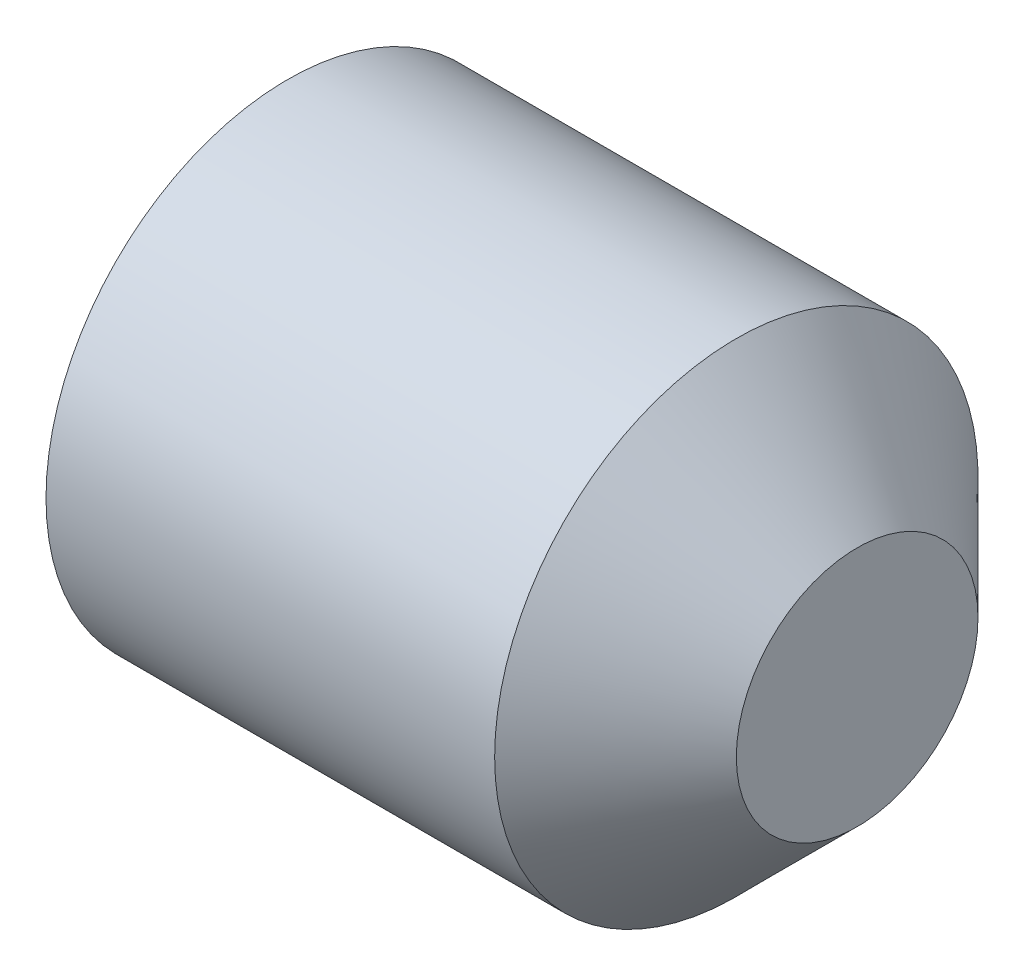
ISO-10303-21;
HEADER;
FILE_DESCRIPTION(('STEP AP214'),'2;1');
FILE_NAME('part.step','',(''),(''),'','','');
FILE_SCHEMA(('AUTOMOTIVE_DESIGN { 1 0 10303 214 1 1 1 1 }'));
ENDSEC;
DATA;
#1=APPLICATION_CONTEXT('core data for automotive mechanical design processes');
#2=APPLICATION_PROTOCOL_DEFINITION('international standard','automotive_design',2000,#1);
#3=PRODUCT_CONTEXT('',#1,'mechanical');
#4=PRODUCT('Part','Part','',(#3));
#5=PRODUCT_RELATED_PRODUCT_CATEGORY('part','',(#4));
#6=PRODUCT_DEFINITION_FORMATION('','',#4);
#7=PRODUCT_DEFINITION_CONTEXT('part definition',#1,'design');
#8=PRODUCT_DEFINITION('design','',#6,#7);
#9=PRODUCT_DEFINITION_SHAPE('','',#8);
#10=(LENGTH_UNIT() NAMED_UNIT(*) SI_UNIT(.MILLI.,.METRE.));
#11=(NAMED_UNIT(*) PLANE_ANGLE_UNIT() SI_UNIT($,.RADIAN.));
#12=(NAMED_UNIT(*) SI_UNIT($,.STERADIAN.) SOLID_ANGLE_UNIT());
#13=UNCERTAINTY_MEASURE_WITH_UNIT(LENGTH_MEASURE(1.E-05),#10,'distance_accuracy_value','');
#14=(GEOMETRIC_REPRESENTATION_CONTEXT(3) GLOBAL_UNCERTAINTY_ASSIGNED_CONTEXT((#13)) GLOBAL_UNIT_ASSIGNED_CONTEXT((#10,
#11,#12)) REPRESENTATION_CONTEXT('',''));
#15=CARTESIAN_POINT('',(0.,0.,0.));
#16=DIRECTION('',(0.,0.,1.));
#17=DIRECTION('',(1.,0.,0.));
#18=AXIS2_PLACEMENT_3D('',#15,#16,#17);
#19=CARTESIAN_POINT('',(0.,0.,0.));
#20=DIRECTION('',(-1.,0.,0.));
#21=DIRECTION('',(0.,0.,1.));
#22=AXIS2_PLACEMENT_3D('',#19,#20,#21);
#23=CYLINDRICAL_SURFACE('',#22,0.799999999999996);
#24=CARTESIAN_POINT('',(1.6,0.,0.));
#25=DIRECTION('',(-1.,0.,0.));
#26=DIRECTION('',(0.,0.,1.));
#27=AXIS2_PLACEMENT_3D('',#24,#25,#26);
#28=CIRCLE('',#27,0.8);
#29=CARTESIAN_POINT('',(1.6,0.,0.8));
#30=VERTEX_POINT('',#29);
#31=EDGE_CURVE('E11',#30,#30,#28,.T.);
#32=ORIENTED_EDGE('',*,*,#31,.T.);
#33=EDGE_LOOP('',(#32));
#34=FACE_BOUND('',#33,.T.);
#35=CARTESIAN_POINT('',(0.114892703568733,0.,0.));
#36=DIRECTION('',(-1.,0.,0.));
#37=DIRECTION('',(0.,0.,1.));
#38=AXIS2_PLACEMENT_3D('',#35,#36,#37);
#39=CIRCLE('',#38,0.799999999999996);
#40=CARTESIAN_POINT('',(0.114892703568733,0.,0.799999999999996));
#41=VERTEX_POINT('',#40);
#42=EDGE_CURVE('E145',#41,#41,#39,.T.);
#43=ORIENTED_EDGE('',*,*,#42,.F.);
#44=EDGE_LOOP('',(#43));
#45=FACE_BOUND('',#44,.T.);
#46=ADVANCED_FACE('F35',(#34,#45),#23,.T.);
#47=CARTESIAN_POINT('',(2.,0.,0.));
#48=DIRECTION('',(-1.,0.,0.));
#49=DIRECTION('',(0.,0.,1.));
#50=AXIS2_PLACEMENT_3D('',#47,#48,#49);
#51=CONICAL_SURFACE('',#50,0.4,0.785398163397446);
#52=ORIENTED_EDGE('',*,*,#31,.F.);
#53=EDGE_LOOP('',(#52));
#54=FACE_BOUND('',#53,.T.);
#55=CARTESIAN_POINT('',(2.,0.,0.));
#56=DIRECTION('',(-1.,0.,0.));
#57=DIRECTION('',(0.,0.,1.));
#58=AXIS2_PLACEMENT_3D('',#55,#56,#57);
#59=CIRCLE('',#58,0.4);
#60=CARTESIAN_POINT('',(2.,0.,0.4));
#61=VERTEX_POINT('',#60);
#62=EDGE_CURVE('E43',#61,#61,#59,.T.);
#63=ORIENTED_EDGE('',*,*,#62,.T.);
#64=EDGE_LOOP('',(#63));
#65=FACE_BOUND('',#64,.T.);
#66=ADVANCED_FACE('F150',(#54,#65),#51,.T.);
#67=CARTESIAN_POINT('',(2.,0.,0.));
#68=DIRECTION('',(-1.,0.,0.));
#69=DIRECTION('',(0.,0.,1.));
#70=AXIS2_PLACEMENT_3D('',#67,#68,#69);
#71=PLANE('',#70);
#72=ORIENTED_EDGE('',*,*,#62,.F.);
#73=EDGE_LOOP('',(#72));
#74=FACE_BOUND('',#73,.T.);
#75=ADVANCED_FACE('F152',(#74),#71,.F.);
#76=CARTESIAN_POINT('',(0.,0.,0.));
#77=DIRECTION('',(1.,0.,0.));
#78=DIRECTION('',(0.,0.,-1.));
#79=AXIS2_PLACEMENT_3D('',#76,#77,#78);
#80=CONICAL_SURFACE('',#79,0.601,1.0471975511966);
#81=ORIENTED_EDGE('',*,*,#42,.T.);
#82=EDGE_LOOP('',(#81));
#83=FACE_BOUND('',#82,.T.);
#84=CARTESIAN_POINT('',(0.,0.,0.));
#85=DIRECTION('',(-1.,0.,0.));
#86=DIRECTION('',(0.,0.,1.));
#87=AXIS2_PLACEMENT_3D('',#84,#85,#86);
#88=CIRCLE('',#87,0.601);
#89=CARTESIAN_POINT('',(0.,0.,0.601));
#90=VERTEX_POINT('',#89);
#91=EDGE_CURVE('E137',#90,#90,#88,.T.);
#92=ORIENTED_EDGE('',*,*,#91,.F.);
#93=EDGE_LOOP('',(#92));
#94=FACE_BOUND('',#93,.T.);
#95=ADVANCED_FACE('F154',(#83,#94),#80,.T.);
#96=CARTESIAN_POINT('',(0.,0.799999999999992,0.));
#97=DIRECTION('',(1.,0.,0.));
#98=DIRECTION('',(0.,0.,-1.));
#99=AXIS2_PLACEMENT_3D('',#96,#97,#98);
#100=PLANE('',#99);
#101=DIRECTION('',(0.,-0.5,-0.866025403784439));
#102=VECTOR('',#101,1.);
#103=CARTESIAN_POINT('',(0.,0.404145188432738,0.));
#104=LINE('',#103,#102);
#105=CARTESIAN_POINT('',(0.,0.404145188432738,0.));
#106=VERTEX_POINT('',#105);
#107=CARTESIAN_POINT('',(0.,0.202072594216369,-0.35));
#108=VERTEX_POINT('',#107);
#109=EDGE_CURVE('E124',#106,#108,#104,.T.);
#110=ORIENTED_EDGE('',*,*,#109,.F.);
#111=DIRECTION('',(0.,0.5,-0.866025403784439));
#112=VECTOR('',#111,1.);
#113=CARTESIAN_POINT('',(0.,0.202072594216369,0.35));
#114=LINE('',#113,#112);
#115=CARTESIAN_POINT('',(0.,0.202072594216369,0.35));
#116=VERTEX_POINT('',#115);
#117=EDGE_CURVE('E50',#116,#106,#114,.T.);
#118=ORIENTED_EDGE('',*,*,#117,.F.);
#119=DIRECTION('',(0.,1.,0.));
#120=VECTOR('',#119,1.);
#121=CARTESIAN_POINT('',(0.,-0.202072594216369,0.35));
#122=LINE('',#121,#120);
#123=CARTESIAN_POINT('',(0.,-0.202072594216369,0.35));
#124=VERTEX_POINT('',#123);
#125=EDGE_CURVE('E133',#124,#116,#122,.T.);
#126=ORIENTED_EDGE('',*,*,#125,.F.);
#127=DIRECTION('',(0.,0.5,0.866025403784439));
#128=VECTOR('',#127,1.);
#129=CARTESIAN_POINT('',(0.,-0.404145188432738,0.));
#130=LINE('',#129,#128);
#131=CARTESIAN_POINT('',(0.,-0.404145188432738,0.));
#132=VERTEX_POINT('',#131);
#133=EDGE_CURVE('E131',#132,#124,#130,.T.);
#134=ORIENTED_EDGE('',*,*,#133,.F.);
#135=DIRECTION('',(0.,-0.5,0.866025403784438));
#136=VECTOR('',#135,1.);
#137=CARTESIAN_POINT('',(0.,-0.202072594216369,-0.35));
#138=LINE('',#137,#136);
#139=CARTESIAN_POINT('',(0.,-0.202072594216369,-0.35));
#140=VERTEX_POINT('',#139);
#141=EDGE_CURVE('E98',#140,#132,#138,.T.);
#142=ORIENTED_EDGE('',*,*,#141,.F.);
#143=DIRECTION('',(0.,-1.,0.));
#144=VECTOR('',#143,1.);
#145=CARTESIAN_POINT('',(0.,0.202072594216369,-0.35));
#146=LINE('',#145,#144);
#147=EDGE_CURVE('E127',#108,#140,#146,.T.);
#148=ORIENTED_EDGE('',*,*,#147,.F.);
#149=EDGE_LOOP('',(#110,#118,#126,#134,#142,#148));
#150=FACE_BOUND('',#149,.T.);
#151=ORIENTED_EDGE('',*,*,#91,.T.);
#152=EDGE_LOOP('',(#151));
#153=FACE_BOUND('',#152,.T.);
#154=ADVANCED_FACE('F37',(#150,#153),#100,.F.);
#155=CARTESIAN_POINT('',(0.7,0.202072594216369,0.35));
#156=DIRECTION('',(0.,0.866025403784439,0.5));
#157=DIRECTION('',(0.,-0.5,0.866025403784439));
#158=AXIS2_PLACEMENT_3D('',#155,#156,#157);
#159=PLANE('',#158);
#160=ORIENTED_EDGE('',*,*,#117,.T.);
#161=DIRECTION('',(-1.,0.,0.));
#162=VECTOR('',#161,1.);
#163=CARTESIAN_POINT('',(0.7,0.404145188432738,0.));
#164=LINE('',#163,#162);
#165=CARTESIAN_POINT('',(0.7,0.404145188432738,0.));
#166=VERTEX_POINT('',#165);
#167=EDGE_CURVE('E80',#166,#106,#164,.T.);
#168=ORIENTED_EDGE('',*,*,#167,.F.);
#169=DIRECTION('',(0.,0.5,-0.866025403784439));
#170=VECTOR('',#169,1.);
#171=CARTESIAN_POINT('',(0.7,0.202072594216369,0.35));
#172=LINE('',#171,#170);
#173=CARTESIAN_POINT('',(0.7,0.202072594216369,0.35));
#174=VERTEX_POINT('',#173);
#175=EDGE_CURVE('E135',#174,#166,#172,.T.);
#176=ORIENTED_EDGE('',*,*,#175,.F.);
#177=DIRECTION('',(-1.,0.,0.));
#178=VECTOR('',#177,1.);
#179=CARTESIAN_POINT('',(0.7,0.202072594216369,0.35));
#180=LINE('',#179,#178);
#181=EDGE_CURVE('E58',#174,#116,#180,.T.);
#182=ORIENTED_EDGE('',*,*,#181,.T.);
#183=EDGE_LOOP('',(#160,#168,#176,#182));
#184=FACE_BOUND('',#183,.T.);
#185=ADVANCED_FACE('F175',(#184),#159,.F.);
#186=CARTESIAN_POINT('',(0.7,-0.202072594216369,0.35));
#187=DIRECTION('',(0.,0.,1.));
#188=DIRECTION('',(0.,-1.,0.));
#189=AXIS2_PLACEMENT_3D('',#186,#187,#188);
#190=PLANE('',#189);
#191=ORIENTED_EDGE('',*,*,#125,.T.);
#192=ORIENTED_EDGE('',*,*,#181,.F.);
#193=DIRECTION('',(0.,1.,0.));
#194=VECTOR('',#193,1.);
#195=CARTESIAN_POINT('',(0.7,-0.202072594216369,0.35));
#196=LINE('',#195,#194);
#197=CARTESIAN_POINT('',(0.7,-0.202072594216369,0.35));
#198=VERTEX_POINT('',#197);
#199=EDGE_CURVE('E110',#198,#174,#196,.T.);
#200=ORIENTED_EDGE('',*,*,#199,.F.);
#201=DIRECTION('',(-1.,0.,0.));
#202=VECTOR('',#201,1.);
#203=CARTESIAN_POINT('',(0.7,-0.202072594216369,0.35));
#204=LINE('',#203,#202);
#205=EDGE_CURVE('E102',#198,#124,#204,.T.);
#206=ORIENTED_EDGE('',*,*,#205,.T.);
#207=EDGE_LOOP('',(#191,#192,#200,#206));
#208=FACE_BOUND('',#207,.T.);
#209=ADVANCED_FACE('F180',(#208),#190,.F.);
#210=CARTESIAN_POINT('',(0.7,-0.404145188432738,0.));
#211=DIRECTION('',(0.,-0.866025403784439,0.5));
#212=DIRECTION('',(0.,-0.5,-0.866025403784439));
#213=AXIS2_PLACEMENT_3D('',#210,#211,#212);
#214=PLANE('',#213);
#215=ORIENTED_EDGE('',*,*,#133,.T.);
#216=ORIENTED_EDGE('',*,*,#205,.F.);
#217=DIRECTION('',(0.,0.5,0.866025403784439));
#218=VECTOR('',#217,1.);
#219=CARTESIAN_POINT('',(0.7,-0.404145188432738,0.));
#220=LINE('',#219,#218);
#221=CARTESIAN_POINT('',(0.7,-0.404145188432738,0.));
#222=VERTEX_POINT('',#221);
#223=EDGE_CURVE('E106',#222,#198,#220,.T.);
#224=ORIENTED_EDGE('',*,*,#223,.F.);
#225=DIRECTION('',(-1.,0.,0.));
#226=VECTOR('',#225,1.);
#227=CARTESIAN_POINT('',(0.7,-0.404145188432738,0.));
#228=LINE('',#227,#226);
#229=EDGE_CURVE('E91',#222,#132,#228,.T.);
#230=ORIENTED_EDGE('',*,*,#229,.T.);
#231=EDGE_LOOP('',(#215,#216,#224,#230));
#232=FACE_BOUND('',#231,.T.);
#233=ADVANCED_FACE('F107',(#232),#214,.F.);
#234=CARTESIAN_POINT('',(0.7,-0.202072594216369,-0.35));
#235=DIRECTION('',(0.,-0.866025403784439,-0.5));
#236=DIRECTION('',(0.,0.5,-0.866025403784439));
#237=AXIS2_PLACEMENT_3D('',#234,#235,#236);
#238=PLANE('',#237);
#239=ORIENTED_EDGE('',*,*,#141,.T.);
#240=ORIENTED_EDGE('',*,*,#229,.F.);
#241=DIRECTION('',(0.,-0.5,0.866025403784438));
#242=VECTOR('',#241,1.);
#243=CARTESIAN_POINT('',(0.7,-0.202072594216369,-0.35));
#244=LINE('',#243,#242);
#245=CARTESIAN_POINT('',(0.7,-0.202072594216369,-0.35));
#246=VERTEX_POINT('',#245);
#247=EDGE_CURVE('E95',#246,#222,#244,.T.);
#248=ORIENTED_EDGE('',*,*,#247,.F.);
#249=DIRECTION('',(-1.,0.,0.));
#250=VECTOR('',#249,1.);
#251=CARTESIAN_POINT('',(0.7,-0.202072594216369,-0.35));
#252=LINE('',#251,#250);
#253=EDGE_CURVE('E103',#246,#140,#252,.T.);
#254=ORIENTED_EDGE('',*,*,#253,.T.);
#255=EDGE_LOOP('',(#239,#240,#248,#254));
#256=FACE_BOUND('',#255,.T.);
#257=ADVANCED_FACE('F93',(#256),#238,.F.);
#258=CARTESIAN_POINT('',(0.7,0.202072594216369,-0.35));
#259=DIRECTION('',(0.,0.,-1.));
#260=DIRECTION('',(-1.,0.,0.));
#261=AXIS2_PLACEMENT_3D('',#258,#259,#260);
#262=PLANE('',#261);
#263=ORIENTED_EDGE('',*,*,#147,.T.);
#264=ORIENTED_EDGE('',*,*,#253,.F.);
#265=DIRECTION('',(0.,-1.,0.));
#266=VECTOR('',#265,1.);
#267=CARTESIAN_POINT('',(0.7,0.202072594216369,-0.35));
#268=LINE('',#267,#266);
#269=CARTESIAN_POINT('',(0.7,0.202072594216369,-0.35));
#270=VERTEX_POINT('',#269);
#271=EDGE_CURVE('E116',#270,#246,#268,.T.);
#272=ORIENTED_EDGE('',*,*,#271,.F.);
#273=DIRECTION('',(-1.,0.,0.));
#274=VECTOR('',#273,1.);
#275=CARTESIAN_POINT('',(0.7,0.202072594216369,-0.35));
#276=LINE('',#275,#274);
#277=EDGE_CURVE('E140',#270,#108,#276,.T.);
#278=ORIENTED_EDGE('',*,*,#277,.T.);
#279=EDGE_LOOP('',(#263,#264,#272,#278));
#280=FACE_BOUND('',#279,.T.);
#281=ADVANCED_FACE('F198',(#280),#262,.F.);
#282=CARTESIAN_POINT('',(0.7,0.404145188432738,0.));
#283=DIRECTION('',(0.,0.866025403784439,-0.5));
#284=DIRECTION('',(0.,0.5,0.866025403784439));
#285=AXIS2_PLACEMENT_3D('',#282,#283,#284);
#286=PLANE('',#285);
#287=ORIENTED_EDGE('',*,*,#109,.T.);
#288=ORIENTED_EDGE('',*,*,#277,.F.);
#289=DIRECTION('',(0.,-0.5,-0.866025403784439));
#290=VECTOR('',#289,1.);
#291=CARTESIAN_POINT('',(0.7,0.404145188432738,0.));
#292=LINE('',#291,#290);
#293=EDGE_CURVE('E118',#166,#270,#292,.T.);
#294=ORIENTED_EDGE('',*,*,#293,.F.);
#295=ORIENTED_EDGE('',*,*,#167,.T.);
#296=EDGE_LOOP('',(#287,#288,#294,#295));
#297=FACE_BOUND('',#296,.T.);
#298=ADVANCED_FACE('F186',(#297),#286,.F.);
#299=CARTESIAN_POINT('',(0.7,0.202072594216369,0.35));
#300=DIRECTION('',(1.,0.,0.));
#301=DIRECTION('',(0.,0.,-1.));
#302=AXIS2_PLACEMENT_3D('',#299,#300,#301);
#303=PLANE('',#302);
#304=ORIENTED_EDGE('',*,*,#175,.T.);
#305=ORIENTED_EDGE('',*,*,#293,.T.);
#306=ORIENTED_EDGE('',*,*,#271,.T.);
#307=ORIENTED_EDGE('',*,*,#247,.T.);
#308=ORIENTED_EDGE('',*,*,#223,.T.);
#309=ORIENTED_EDGE('',*,*,#199,.T.);
#310=EDGE_LOOP('',(#304,#305,#306,#307,#308,#309));
#311=FACE_BOUND('',#310,.T.);
#312=ADVANCED_FACE('F113',(#311),#303,.F.);
#313=CLOSED_SHELL('',(#46,#66,#75,#95,#154,#185,#209,#233,#257,#281,#298,#312));
#314=MANIFOLD_SOLID_BREP('B2',#313);
#315=ADVANCED_BREP_SHAPE_REPRESENTATION('',(#18,#314),#14);
#316=SHAPE_DEFINITION_REPRESENTATION(#9,#315);
ENDSEC;
END-ISO-10303-21;
